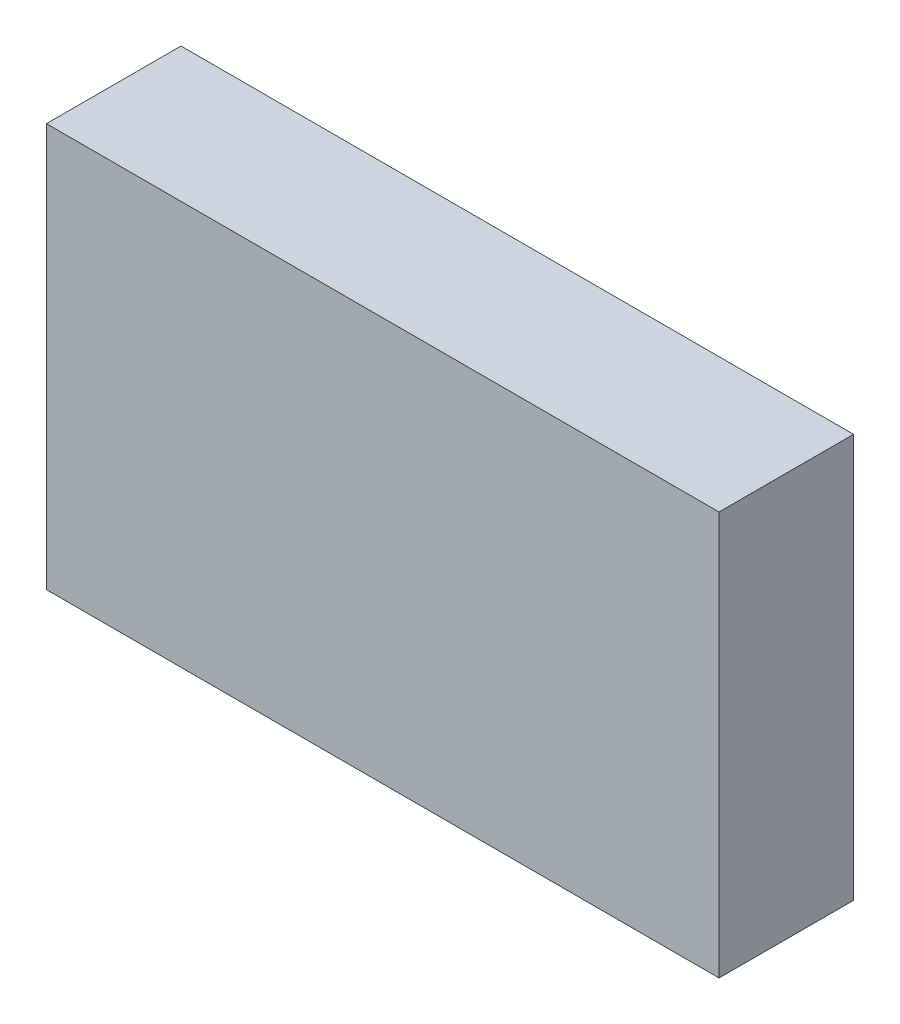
ISO-10303-21;
HEADER;
FILE_DESCRIPTION(('STEP AP214'),'2;1');
FILE_NAME('part.step','',(''),(''),'','','');
FILE_SCHEMA(('AUTOMOTIVE_DESIGN { 1 0 10303 214 1 1 1 1 }'));
ENDSEC;
DATA;
#1=APPLICATION_CONTEXT('core data for automotive mechanical design processes');
#2=APPLICATION_PROTOCOL_DEFINITION('international standard','automotive_design',2000,#1);
#3=PRODUCT_CONTEXT('',#1,'mechanical');
#4=PRODUCT('Part','Part','',(#3));
#5=PRODUCT_RELATED_PRODUCT_CATEGORY('part','',(#4));
#6=PRODUCT_DEFINITION_FORMATION('','',#4);
#7=PRODUCT_DEFINITION_CONTEXT('part definition',#1,'design');
#8=PRODUCT_DEFINITION('design','',#6,#7);
#9=PRODUCT_DEFINITION_SHAPE('','',#8);
#10=(LENGTH_UNIT() NAMED_UNIT(*) SI_UNIT(.MILLI.,.METRE.));
#11=(NAMED_UNIT(*) PLANE_ANGLE_UNIT() SI_UNIT($,.RADIAN.));
#12=(NAMED_UNIT(*) SI_UNIT($,.STERADIAN.) SOLID_ANGLE_UNIT());
#13=UNCERTAINTY_MEASURE_WITH_UNIT(LENGTH_MEASURE(1.E-05),#10,'distance_accuracy_value','');
#14=(GEOMETRIC_REPRESENTATION_CONTEXT(3) GLOBAL_UNCERTAINTY_ASSIGNED_CONTEXT((#13)) GLOBAL_UNIT_ASSIGNED_CONTEXT((#10,
#11,#12)) REPRESENTATION_CONTEXT('',''));
#15=CARTESIAN_POINT('',(0.,0.,0.));
#16=DIRECTION('',(0.,0.,1.));
#17=DIRECTION('',(1.,0.,0.));
#18=AXIS2_PLACEMENT_3D('',#15,#16,#17);
#19=CARTESIAN_POINT('',(31.7499999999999,0.,6.34999999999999));
#20=DIRECTION('',(0.,1.,0.));
#21=DIRECTION('',(0.,0.,1.));
#22=AXIS2_PLACEMENT_3D('',#19,#20,#21);
#23=PLANE('',#22);
#24=DIRECTION('',(0.,0.,-1.));
#25=VECTOR('',#24,1.);
#26=CARTESIAN_POINT('',(0.,0.,6.34999999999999));
#27=LINE('',#26,#25);
#28=CARTESIAN_POINT('',(0.,0.,6.34999999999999));
#29=VERTEX_POINT('',#28);
#30=CARTESIAN_POINT('',(0.,0.,0.));
#31=VERTEX_POINT('',#30);
#32=EDGE_CURVE('E115',#29,#31,#27,.T.);
#33=ORIENTED_EDGE('',*,*,#32,.T.);
#34=DIRECTION('',(-1.,0.,0.));
#35=VECTOR('',#34,1.);
#36=CARTESIAN_POINT('',(31.7499999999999,0.,0.));
#37=LINE('',#36,#35);
#38=CARTESIAN_POINT('',(31.7499999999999,0.,0.));
#39=VERTEX_POINT('',#38);
#40=EDGE_CURVE('E11',#39,#31,#37,.T.);
#41=ORIENTED_EDGE('',*,*,#40,.F.);
#42=DIRECTION('',(0.,0.,-1.));
#43=VECTOR('',#42,1.);
#44=CARTESIAN_POINT('',(31.7499999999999,0.,6.34999999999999));
#45=LINE('',#44,#43);
#46=CARTESIAN_POINT('',(31.7499999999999,0.,6.34999999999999));
#47=VERTEX_POINT('',#46);
#48=EDGE_CURVE('E94',#47,#39,#45,.T.);
#49=ORIENTED_EDGE('',*,*,#48,.F.);
#50=DIRECTION('',(-1.,0.,0.));
#51=VECTOR('',#50,1.);
#52=CARTESIAN_POINT('',(31.7499999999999,0.,6.34999999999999));
#53=LINE('',#52,#51);
#54=EDGE_CURVE('E106',#47,#29,#53,.T.);
#55=ORIENTED_EDGE('',*,*,#54,.T.);
#56=EDGE_LOOP('',(#33,#41,#49,#55));
#57=FACE_BOUND('',#56,.T.);
#58=ADVANCED_FACE('F43',(#57),#23,.F.);
#59=CARTESIAN_POINT('',(31.7499999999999,0.,0.));
#60=DIRECTION('',(0.,0.,1.));
#61=DIRECTION('',(1.,0.,0.));
#62=AXIS2_PLACEMENT_3D('',#59,#60,#61);
#63=PLANE('',#62);
#64=DIRECTION('',(0.,1.,0.));
#65=VECTOR('',#64,1.);
#66=CARTESIAN_POINT('',(0.,0.,0.));
#67=LINE('',#66,#65);
#68=CARTESIAN_POINT('',(0.,19.05,0.));
#69=VERTEX_POINT('',#68);
#70=EDGE_CURVE('E99',#31,#69,#67,.T.);
#71=ORIENTED_EDGE('',*,*,#70,.T.);
#72=DIRECTION('',(-1.,0.,0.));
#73=VECTOR('',#72,1.);
#74=CARTESIAN_POINT('',(31.7499999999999,19.05,0.));
#75=LINE('',#74,#73);
#76=CARTESIAN_POINT('',(31.7499999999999,19.05,0.));
#77=VERTEX_POINT('',#76);
#78=EDGE_CURVE('E55',#77,#69,#75,.T.);
#79=ORIENTED_EDGE('',*,*,#78,.F.);
#80=DIRECTION('',(0.,1.,0.));
#81=VECTOR('',#80,1.);
#82=CARTESIAN_POINT('',(31.7499999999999,0.,0.));
#83=LINE('',#82,#81);
#84=EDGE_CURVE('E89',#39,#77,#83,.T.);
#85=ORIENTED_EDGE('',*,*,#84,.F.);
#86=ORIENTED_EDGE('',*,*,#40,.T.);
#87=EDGE_LOOP('',(#71,#79,#85,#86));
#88=FACE_BOUND('',#87,.T.);
#89=ADVANCED_FACE('F98',(#88),#63,.F.);
#90=CARTESIAN_POINT('',(31.7499999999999,19.05,0.));
#91=DIRECTION('',(0.,-1.,0.));
#92=DIRECTION('',(0.,0.,-1.));
#93=AXIS2_PLACEMENT_3D('',#90,#91,#92);
#94=PLANE('',#93);
#95=DIRECTION('',(0.,0.,1.));
#96=VECTOR('',#95,1.);
#97=CARTESIAN_POINT('',(0.,19.05,0.));
#98=LINE('',#97,#96);
#99=CARTESIAN_POINT('',(0.,19.05,6.34999999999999));
#100=VERTEX_POINT('',#99);
#101=EDGE_CURVE('E77',#69,#100,#98,.T.);
#102=ORIENTED_EDGE('',*,*,#101,.T.);
#103=DIRECTION('',(-1.,0.,0.));
#104=VECTOR('',#103,1.);
#105=CARTESIAN_POINT('',(31.7499999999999,19.05,6.34999999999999));
#106=LINE('',#105,#104);
#107=CARTESIAN_POINT('',(31.7499999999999,19.05,6.34999999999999));
#108=VERTEX_POINT('',#107);
#109=EDGE_CURVE('E105',#108,#100,#106,.T.);
#110=ORIENTED_EDGE('',*,*,#109,.F.);
#111=DIRECTION('',(0.,0.,1.));
#112=VECTOR('',#111,1.);
#113=CARTESIAN_POINT('',(31.7499999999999,19.05,0.));
#114=LINE('',#113,#112);
#115=EDGE_CURVE('E93',#77,#108,#114,.T.);
#116=ORIENTED_EDGE('',*,*,#115,.F.);
#117=ORIENTED_EDGE('',*,*,#78,.T.);
#118=EDGE_LOOP('',(#102,#110,#116,#117));
#119=FACE_BOUND('',#118,.T.);
#120=ADVANCED_FACE('F104',(#119),#94,.F.);
#121=CARTESIAN_POINT('',(31.7499999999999,19.05,6.34999999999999));
#122=DIRECTION('',(0.,0.,-1.));
#123=DIRECTION('',(-1.,0.,0.));
#124=AXIS2_PLACEMENT_3D('',#121,#122,#123);
#125=PLANE('',#124);
#126=DIRECTION('',(0.,-1.,0.));
#127=VECTOR('',#126,1.);
#128=CARTESIAN_POINT('',(0.,19.05,6.34999999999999));
#129=LINE('',#128,#127);
#130=EDGE_CURVE('E81',#100,#29,#129,.T.);
#131=ORIENTED_EDGE('',*,*,#130,.T.);
#132=ORIENTED_EDGE('',*,*,#54,.F.);
#133=DIRECTION('',(0.,-1.,0.));
#134=VECTOR('',#133,1.);
#135=CARTESIAN_POINT('',(31.7499999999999,19.05,6.34999999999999));
#136=LINE('',#135,#134);
#137=EDGE_CURVE('E58',#108,#47,#136,.T.);
#138=ORIENTED_EDGE('',*,*,#137,.F.);
#139=ORIENTED_EDGE('',*,*,#109,.T.);
#140=EDGE_LOOP('',(#131,#132,#138,#139));
#141=FACE_BOUND('',#140,.T.);
#142=ADVANCED_FACE('F128',(#141),#125,.F.);
#143=CARTESIAN_POINT('',(31.7499999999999,0.,0.));
#144=DIRECTION('',(1.,0.,0.));
#145=DIRECTION('',(0.,0.,-1.));
#146=AXIS2_PLACEMENT_3D('',#143,#144,#145);
#147=PLANE('',#146);
#148=ORIENTED_EDGE('',*,*,#48,.T.);
#149=ORIENTED_EDGE('',*,*,#84,.T.);
#150=ORIENTED_EDGE('',*,*,#115,.T.);
#151=ORIENTED_EDGE('',*,*,#137,.T.);
#152=EDGE_LOOP('',(#148,#149,#150,#151));
#153=FACE_BOUND('',#152,.T.);
#154=ADVANCED_FACE('F91',(#153),#147,.T.);
#155=CARTESIAN_POINT('',(0.,0.,0.));
#156=DIRECTION('',(1.,0.,0.));
#157=DIRECTION('',(0.,0.,-1.));
#158=AXIS2_PLACEMENT_3D('',#155,#156,#157);
#159=PLANE('',#158);
#160=ORIENTED_EDGE('',*,*,#32,.F.);
#161=ORIENTED_EDGE('',*,*,#130,.F.);
#162=ORIENTED_EDGE('',*,*,#101,.F.);
#163=ORIENTED_EDGE('',*,*,#70,.F.);
#164=EDGE_LOOP('',(#160,#161,#162,#163));
#165=FACE_BOUND('',#164,.T.);
#166=ADVANCED_FACE('F129',(#165),#159,.F.);
#167=CLOSED_SHELL('',(#58,#89,#120,#142,#154,#166));
#168=MANIFOLD_SOLID_BREP('B2',#167);
#169=ADVANCED_BREP_SHAPE_REPRESENTATION('',(#18,#168),#14);
#170=SHAPE_DEFINITION_REPRESENTATION(#9,#169);
ENDSEC;
END-ISO-10303-21;
